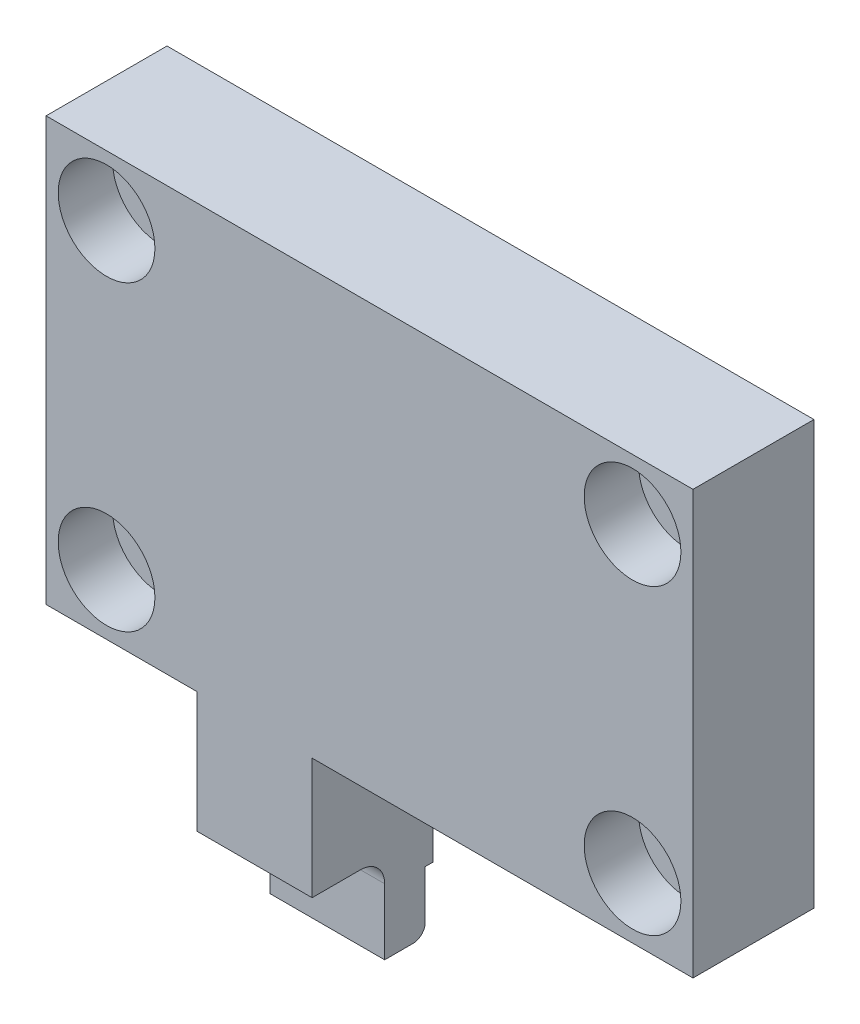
from build123d import *

# Parameters (mm, degrees)
SKETCH_1_R          = 2.25
EXTRUDE_1_DEPTH     = 10
SKETCH_2_R          = 4
CUT_EXTRUDE_1_DEPTH = 4.5
SKETCH_3_OUTSIDE_W  = 27.118
SKETCH_3_OUTSIDE_H  = 69.568
CUT_EXTRUDE_2_DEPTH = 76.586059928


with BuildPart() as part:
    # Sketch 1 → Extrude 1 (new body)
    with BuildSketch(Plane.XY):
        Polygon((0, 17.449999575), (0, 52.449999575), (53.5, 52.449999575), (53.5, 17.449999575), (22, 17.449999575), (22, 0), (12.5, 0), (12.5, 17.449999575), align=None)
        with Locations((5, 47.449999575)):
            Circle(SKETCH_1_R, mode=Mode.SUBTRACT)
        with Locations((48.5, 47.449999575)):
            Circle(SKETCH_1_R, mode=Mode.SUBTRACT)
        with Locations((48.5, 22.449999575)):
            Circle(SKETCH_1_R, mode=Mode.SUBTRACT)
        with Locations((5, 22.449999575)):
            Circle(SKETCH_1_R, mode=Mode.SUBTRACT)
    extrude(amount=EXTRUDE_1_DEPTH)

    # Sketch 2 → Cut-Extrude 1 (cut)
    with BuildSketch(Plane.XY.offset(10)):
        with Locations((5, 47.449999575)):
            Circle(SKETCH_2_R)
        with Locations((48.5, 47.449999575)):
            Circle(SKETCH_2_R)
        with Locations((48.5, 22.449999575)):
            Circle(SKETCH_2_R)
        with Locations((5, 22.449999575)):
            Circle(SKETCH_2_R)
    extrude(amount=-CUT_EXTRUDE_1_DEPTH, mode=Mode.SUBTRACT)

    # Sketch 3 outside → Cut-Extrude 2 (cut, through all)
    with BuildSketch(Plane(origin=(53.5, 0, 0), x_dir=(0, 0, -1), z_dir=(1, 0, 0))):
        with Locations((-5, 26.225)):
            Rectangle(SKETCH_3_OUTSIDE_W, SKETCH_3_OUTSIDE_H)
        with BuildLine():
            Line((0, 5), (0, 52.449999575))
            Line((0, 52.449999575), (-10, 52.449999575))
            Line((-10, 52.449999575), (-10, 7.449999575))
            Line((-10, 7.449999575), (-6, 7.449999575))
            ThreePointArc((-6, 7.449999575), (-4.585786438, 6.864213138), (-4, 5.449999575))
            Line((-4, 5.449999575), (-4, 0))
            Line((-4, 0), (-1.65, 0))
            ThreePointArc((-1.65, 0), (-0.942893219, 0.292893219), (-0.65, 1))
            Line((-0.65, 1), (-0.65, 5))
            Line((-0.65, 5), (0, 5))
        make_face(mode=Mode.SUBTRACT)
    extrude(amount=-CUT_EXTRUDE_2_DEPTH, mode=Mode.SUBTRACT)


solid = part.part
